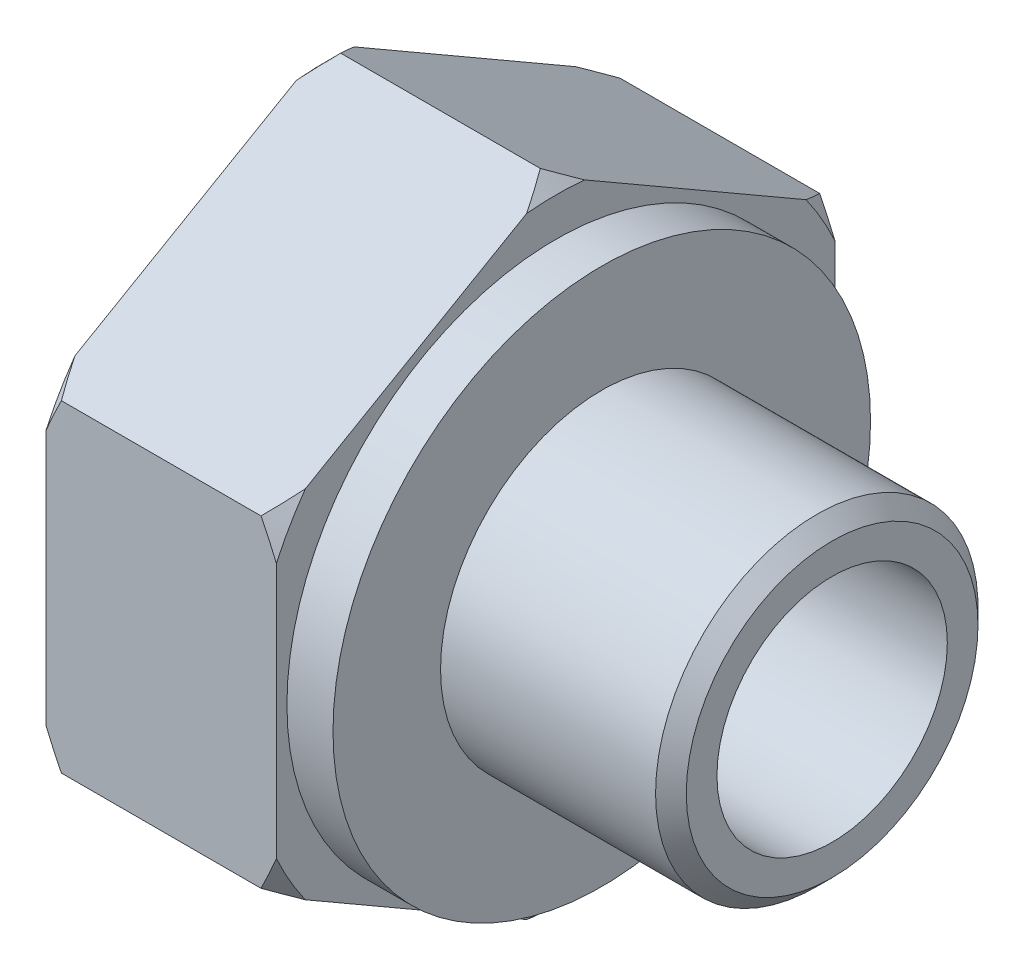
from build123d import *

# Parameters (mm, degrees)
CHANFREIN1_SIZE         = 1
ESQUISSE2_OUTSIDE_W     = 57.59
ESQUISSE2_OUTSIDE_H     = 57.59
ENL_V_MAT_EXTRU_1_DEPTH = 45.395945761


with BuildPart() as part:
    # Esquisse1 → R_volution1 (revolve)
    with BuildSketch(Plane.XY, mode=Mode.PRIVATE) as r_volution1_sk:
        Polygon((46.271705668, 7.5), (46.271705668, 10.4975), (31.271705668, 10.4975), (31.271705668, 17.5), (28.271705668, 17.5), (28.271705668, 21), (13.271705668, 21), (13.271705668, 0), (23.298380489, 0), (23.298380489, 7.5), align=None)
    revolve(r_volution1_sk.sketch.rotate(Axis((-49.434162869, 0, 0), (1, 0, 0)), 90), axis=Axis((-49.434162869, 0, 0), (1, 0, 0)))

    # Chanfrein1
    chanfrein1_edges = [part.edges().sort_by_distance(p)[0] for p in [
        (46.271705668, 0, -10.4975),
        (28.271705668, 0, -21),
        (13.271705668, 0, -21),
    ]]
    chamfer(chanfrein1_edges, length=CHANFREIN1_SIZE)

    # Esquisse2 outside → Enl_v. mat.-Extru.1 (cut, through all)
    with BuildSketch(Plane.ZY.offset(-13.271705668)):
        Rectangle(ESQUISSE2_OUTSIDE_W, ESQUISSE2_OUTSIDE_H)
        Polygon((0, 21), (-18.186533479, 10.5), (-18.186533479, -10.5), (0, -21), (18.186533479, -10.5), (18.186533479, 10.5), align=None, mode=Mode.SUBTRACT)
    extrude(amount=-ENL_V_MAT_EXTRU_1_DEPTH, mode=Mode.SUBTRACT)


solid = part.part
